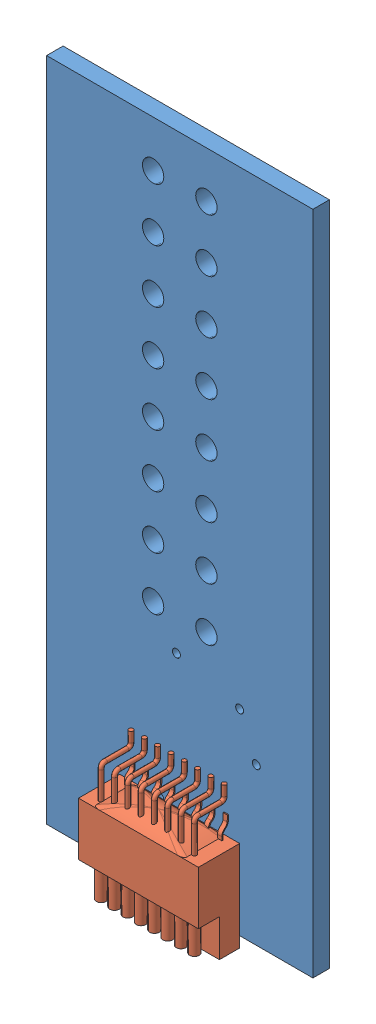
SolidWorks assembly RHS_SPI_Cable_Adapter.SLDASM, configuration Default (file format 15000). Lengths in mm.
Overall size (12.7 32.26 2.83).
2 component instances, 2 part files, 2 mates.
Components (placement in the parent):
- RHS_SPI_Cable_Adapter_PCB-1: RHS_SPI_Cable_Adapter_PCB.SLDPRT [Default] at origin size (12.7 31.75 0.79)
- A79633-001-1: A79633-001.SLDPRT [Default] at (6.35 3.81 0.7874) x (1 0 0) z (0 -1 0) size (5.72 2.06 6.53)
Mates (geometry in assembly coordinates):
- Coincident1: coincident anti-aligned: plane of RHS_SPI_Cable_Adapter-1 through (0 0 0.7874) normal (0 0 1); plane of A79633-001-1 through (6.35 3.81 0.7874) normal (0 0 -1)
- Parallel1: parallel aligned: plane of RHS_SPI_Cable_Adapter-1 through (12.7 0 0.7874) normal (0 -1 0); plane of A79633-001-1 through (6.35 -0.508 0.7874) normal (0 -1 0)
